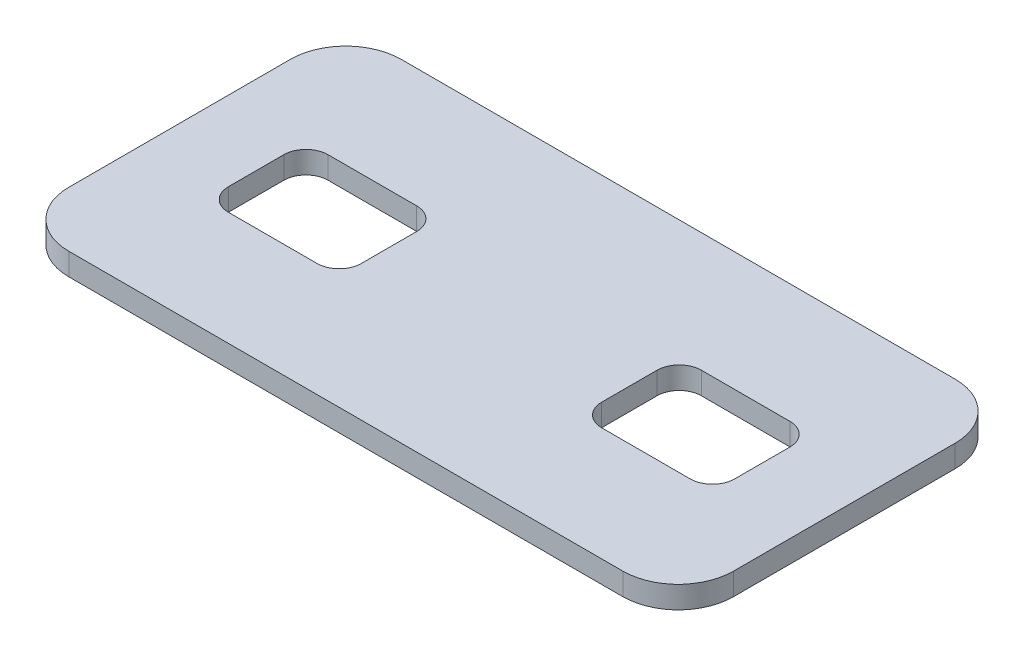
from build123d import *

# Parameters (mm, degrees)
EXTRUDE_1_DEPTH      = 26
CUT_EXTRUDE_1_DEPTH  = 15
CUT_EXTRUDE_2_DEPTH  = 13
CUT_EXTRUDE_3_DEPTH  = 3
SKETCH_4_R           = 4
CUT_EXTRUDE_4_DEPTH  = 5
CUT_EXTRUDE_5_DEPTH  = 68.178330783
SKETCH_7_W           = 68.842653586
SKETCH_7_H           = 38.311408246
CUT_EXTRUDE_7_DEPTH  = 3
SKETCH_8_W           = 71.267746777
SKETCH_8_H           = 39.031871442
CUT_EXTRUDE_8_DEPTH  = 6
CUT_EXTRUDE_10_DEPTH = 10


with BuildPart() as part:
    # Sketch 1 → Extrude 1 (new body)
    with BuildSketch(Plane(origin=(0, 0, 0), x_dir=(1, 0, 0), z_dir=(0, 1, 0))):
        with BuildLine():
            ThreePointArc((-36.372007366, 5.05801105), (-33.443075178, 12.129078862), (-26.372007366, 15.05801105))
            Line((-26.372007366, 15.05801105), (32.627992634, 15.05801105))
            ThreePointArc((32.627992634, 15.05801105), (39.699060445, 12.129078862), (42.627992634, 5.05801105))
            Line((42.627992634, 5.05801105), (42.627992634, -34.94198895))
            ThreePointArc((42.627992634, -34.94198895), (39.699060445, -42.013056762), (32.627992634, -44.94198895))
            Line((32.627992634, -44.94198895), (-26.372007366, -44.94198895))
            ThreePointArc((-26.372007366, -44.94198895), (-33.443075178, -42.013056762), (-36.372007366, -34.94198895))
            Line((-36.372007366, -34.94198895), (-36.372007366, 5.05801105))
        make_face()
    extrude(amount=EXTRUDE_1_DEPTH)

    # Sketch 2 → Cut-Extrude 1 (cut)
    with BuildSketch(Plane(origin=(0, 26, 0), x_dir=(1, 0, 0), z_dir=(0, 1, 0))):
        with BuildLine():
            Line((28.127992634, -37.94198895), (-21.872007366, -37.94198895))
            ThreePointArc((-21.872007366, -37.94198895), (-25.407541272, -36.477522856), (-26.872007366, -32.94198895))
            Line((-26.872007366, -32.94198895), (-26.872007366, -12.94198895))
            ThreePointArc((-26.872007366, -12.94198895), (-25.407541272, -9.406455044), (-21.872007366, -7.94198895))
            Line((-21.872007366, -7.94198895), (28.127992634, -7.94198895))
            ThreePointArc((28.127992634, -7.94198895), (31.663526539, -9.406455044), (33.127992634, -12.94198895))
            Line((33.127992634, -12.94198895), (33.127992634, -32.94198895))
            ThreePointArc((33.127992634, -32.94198895), (31.663526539, -36.477522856), (28.127992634, -37.94198895))
        make_face()
    extrude(amount=-CUT_EXTRUDE_1_DEPTH, mode=Mode.SUBTRACT)

    # Sketch 2_5 → Cut-Extrude 2 (cut)
    with BuildSketch(Plane(origin=(0, 26, 0), x_dir=(1, 0, 0), z_dir=(0, 1, 0))):
        with BuildLine():
            Line((-19.372007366, -7.94198895), (25.627992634, -7.94198895))
            Line((25.627992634, -7.94198895), (25.627992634, 2.05801105))
            ThreePointArc((25.627992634, 2.05801105), (24.163526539, 5.593544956), (20.627992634, 7.05801105))
            Line((20.627992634, 7.05801105), (-14.372007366, 7.05801105))
            ThreePointArc((-14.372007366, 7.05801105), (-17.907541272, 5.593544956), (-19.372007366, 2.05801105))
            Line((-19.372007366, 2.05801105), (-19.372007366, -7.94198895))
        make_face()
    extrude(amount=-CUT_EXTRUDE_2_DEPTH, mode=Mode.SUBTRACT)

    # Sketch 3 → Cut-Extrude 3 (cut)
    with BuildSketch(Plane(origin=(0, 11, 0), x_dir=(1, 0, 0), z_dir=(0, 1, 0))):
        with BuildLine():
            ThreePointArc((-16.715889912, -17.999323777), (-19.160677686, -25.716247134), (-11.694757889, -28.844814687))
            add(Edge.make_bspline(
                [(-11.694757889, -28.844814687), (-7.070667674, -27.190479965), (2.758354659, -25.914696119), (13.021491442, -27.05610032), (17.925131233, -28.835586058)],
                knots=[0.146877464, 0.146877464, 0.146877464, 0.146877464, 0.498521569, 0.873518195, 0.873518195, 0.873518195, 0.873518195], degree=3))
            ThreePointArc((17.925131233, -28.835586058), (25.410930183, -25.728592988), (22.971875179, -17.999323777))
            add(Edge.make_bspline(
                [(-16.715889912, -17.999323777), (-10.305938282, -14.298536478), (2.976905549, -11.649443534), (16.864097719, -14.472996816), (22.971875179, -17.999323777)],
                knots=[0, 0, 0, 0, 0.5, 1, 1, 1, 1], degree=3))
        make_face()
    extrude(amount=-CUT_EXTRUDE_3_DEPTH, mode=Mode.SUBTRACT)

    # Sketch 4 → Cut-Extrude 4 (cut)
    with BuildSketch(Plane(origin=(0, 8, 0), x_dir=(1, 0, 0), z_dir=(0, 1, 0))):
        with Locations(Location((-13.715889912, -23.1954762, 0), (0, 0, 270))):
            Circle(SKETCH_4_R)
        with Locations(Location((19.971875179, -23.1954762, 0), (0, 0, 270))):
            Circle(SKETCH_4_R)
    extrude(amount=-CUT_EXTRUDE_4_DEPTH, mode=Mode.SUBTRACT)

    # Sketch 2_6 → Cut-Extrude 5 (cut, through all)
    # profile 1 of 2: a face of its own
    with BuildSketch(Plane(origin=(0, 26, 0), x_dir=(1, 0, 0), z_dir=(0, 1, 0))):
        with BuildLine():
            Line((32.627992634, 15.05801105), (-26.372007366, 15.05801105))
            ThreePointArc((-26.372007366, 15.05801105), (-33.443075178, 12.129078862), (-36.372007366, 5.05801105))
            Line((-36.372007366, 5.05801105), (-36.372007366, -34.94198895))
            ThreePointArc((-36.372007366, -34.94198895), (-33.443075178, -42.013056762), (-26.372007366, -44.94198895))
            Line((-26.372007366, -44.94198895), (32.627992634, -44.94198895))
            ThreePointArc((32.627992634, -44.94198895), (39.699060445, -42.013056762), (42.627992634, -34.94198895))
            Line((42.627992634, -34.94198895), (42.627992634, 5.05801105))
            ThreePointArc((42.627992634, 5.05801105), (39.699060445, 12.129078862), (32.627992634, 15.05801105))
        make_face()
        with BuildLine():
            ThreePointArc((33.127992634, -32.94198895), (31.663526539, -36.477522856), (28.127992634, -37.94198895))
            Line((28.127992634, -37.94198895), (-21.872007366, -37.94198895))
            ThreePointArc((-21.872007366, -37.94198895), (-25.407541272, -36.477522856), (-26.872007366, -32.94198895))
            Line((-26.872007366, -32.94198895), (-26.872007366, -12.94198895))
            ThreePointArc((-26.872007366, -12.94198895), (-25.407541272, -9.406455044), (-21.872007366, -7.94198895))
            Line((-21.872007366, -7.94198895), (-19.372007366, -7.94198895))
            Line((-19.372007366, -7.94198895), (-19.372007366, 2.05801105))
            ThreePointArc((-19.372007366, 2.05801105), (-17.907541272, 5.593544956), (-14.372007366, 7.05801105))
            Line((-14.372007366, 7.05801105), (20.627992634, 7.05801105))
            ThreePointArc((20.627992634, 7.05801105), (24.163526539, 5.593544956), (25.627992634, 2.05801105))
            Line((25.627992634, 2.05801105), (25.627992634, -7.94198895))
            Line((25.627992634, -7.94198895), (28.127992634, -7.94198895))
            ThreePointArc((28.127992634, -7.94198895), (31.663526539, -9.406455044), (33.127992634, -12.94198895))
            Line((33.127992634, -12.94198895), (33.127992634, -32.94198895))
        make_face(mode=Mode.SUBTRACT)
    # profile 2 of 2: a face of its own
    with BuildSketch(Plane(origin=(0, 26, 0), x_dir=(1, 0, 0), z_dir=(0, 1, 0))):
        with BuildLine():
            Line((-19.372007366, -7.94198895), (25.627992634, -7.94198895))
            Line((25.627992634, -7.94198895), (25.627992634, 2.05801105))
            ThreePointArc((25.627992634, 2.05801105), (24.163526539, 5.593544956), (20.627992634, 7.05801105))
            Line((20.627992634, 7.05801105), (-14.372007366, 7.05801105))
            ThreePointArc((-14.372007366, 7.05801105), (-17.907541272, 5.593544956), (-19.372007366, 2.05801105))
            Line((-19.372007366, 2.05801105), (-19.372007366, -7.94198895))
        make_face()
    extrude(amount=-CUT_EXTRUDE_5_DEPTH, mode=Mode.SUBTRACT)

    # Sketch 7 → Cut-Extrude 7 (cut)
    with BuildSketch(Plane.XZ):
        with Locations((3.186933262, 23.384043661)):
            Rectangle(SKETCH_7_W, SKETCH_7_H)
    extrude(amount=-CUT_EXTRUDE_7_DEPTH, mode=Mode.SUBTRACT)

    # Sketch 8 → Cut-Extrude 8 (cut)
    with BuildSketch(Plane(origin=(0, 11, 0), x_dir=(1, 0, 0), z_dir=(0, 1, 0))):
        with Locations((2.316081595, -22.220290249)):
            Rectangle(SKETCH_8_W, SKETCH_8_H)
    extrude(amount=-CUT_EXTRUDE_8_DEPTH, mode=Mode.SUBTRACT)

    # Sketch 9 → Cut-Extrude 10 (cut)
    with BuildSketch(Plane.XZ.offset(-3)):
        with BuildLine():
            Line((-17.715889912, 18.6954762), (-9.715889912, 18.6954762))
            ThreePointArc((-9.715889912, 18.6954762), (-8.30167635, 19.281262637), (-7.715889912, 20.6954762))
            Line((-7.715889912, 20.6954762), (-7.715889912, 25.6954762))
            ThreePointArc((-7.715889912, 25.6954762), (-8.30167635, 27.109689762), (-9.715889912, 27.6954762))
            Line((-9.715889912, 27.6954762), (-17.715889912, 27.6954762))
            ThreePointArc((-17.715889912, 27.6954762), (-19.130103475, 27.109689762), (-19.715889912, 25.6954762))
            Line((-19.715889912, 25.6954762), (-19.715889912, 20.6954762))
            ThreePointArc((-19.715889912, 20.6954762), (-19.130103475, 19.281262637), (-17.715889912, 18.6954762))
        make_face()
        with BuildLine():
            Line((15.971875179, 18.6954762), (23.971875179, 18.6954762))
            ThreePointArc((23.971875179, 18.6954762), (25.386088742, 19.281262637), (25.971875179, 20.6954762))
            Line((25.971875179, 20.6954762), (25.971875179, 25.6954762))
            ThreePointArc((25.971875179, 25.6954762), (25.386088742, 27.109689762), (23.971875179, 27.6954762))
            Line((23.971875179, 27.6954762), (15.971875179, 27.6954762))
            ThreePointArc((15.971875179, 27.6954762), (14.557661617, 27.109689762), (13.971875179, 25.6954762))
            Line((13.971875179, 25.6954762), (13.971875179, 20.6954762))
            ThreePointArc((13.971875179, 20.6954762), (14.557661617, 19.281262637), (15.971875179, 18.6954762))
        make_face()
    extrude(amount=-CUT_EXTRUDE_10_DEPTH, mode=Mode.SUBTRACT)


solid = part.part
